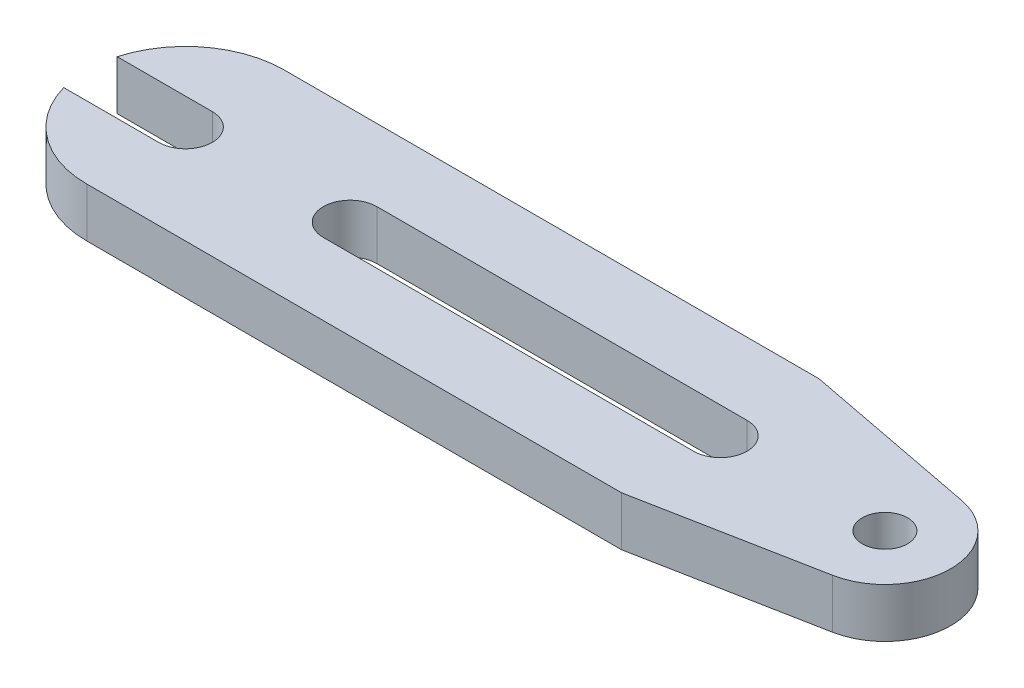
ISO-10303-21;
HEADER;
FILE_DESCRIPTION(('STEP AP214'),'2;1');
FILE_NAME('part.step','',(''),(''),'','','');
FILE_SCHEMA(('AUTOMOTIVE_DESIGN { 1 0 10303 214 1 1 1 1 }'));
ENDSEC;
DATA;
#1=APPLICATION_CONTEXT('core data for automotive mechanical design processes');
#2=APPLICATION_PROTOCOL_DEFINITION('international standard','automotive_design',2000,#1);
#3=PRODUCT_CONTEXT('',#1,'mechanical');
#4=PRODUCT('Part','Part','',(#3));
#5=PRODUCT_RELATED_PRODUCT_CATEGORY('part','',(#4));
#6=PRODUCT_DEFINITION_FORMATION('','',#4);
#7=PRODUCT_DEFINITION_CONTEXT('part definition',#1,'design');
#8=PRODUCT_DEFINITION('design','',#6,#7);
#9=PRODUCT_DEFINITION_SHAPE('','',#8);
#10=(LENGTH_UNIT() NAMED_UNIT(*) SI_UNIT(.MILLI.,.METRE.));
#11=(NAMED_UNIT(*) PLANE_ANGLE_UNIT() SI_UNIT($,.RADIAN.));
#12=(NAMED_UNIT(*) SI_UNIT($,.STERADIAN.) SOLID_ANGLE_UNIT());
#13=UNCERTAINTY_MEASURE_WITH_UNIT(LENGTH_MEASURE(1.E-05),#10,'distance_accuracy_value','');
#14=(GEOMETRIC_REPRESENTATION_CONTEXT(3) GLOBAL_UNCERTAINTY_ASSIGNED_CONTEXT((#13)) GLOBAL_UNIT_ASSIGNED_CONTEXT((#10,
#11,#12)) REPRESENTATION_CONTEXT('',''));
#15=CARTESIAN_POINT('',(0.,0.,0.));
#16=DIRECTION('',(0.,0.,1.));
#17=DIRECTION('',(1.,0.,0.));
#18=AXIS2_PLACEMENT_3D('',#15,#16,#17);
#19=CARTESIAN_POINT('',(85.,6.,0.));
#20=DIRECTION('',(0.,1.,0.));
#21=DIRECTION('',(0.,0.,1.));
#22=AXIS2_PLACEMENT_3D('',#19,#20,#21);
#23=PLANE('',#22);
#24=CARTESIAN_POINT('',(85.,6.,0.));
#25=DIRECTION('',(0.,1.,0.));
#26=DIRECTION('',(0.,0.,1.));
#27=AXIS2_PLACEMENT_3D('',#24,#25,#26);
#28=CIRCLE('',#27,2.75000000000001);
#29=CARTESIAN_POINT('',(85.,6.,2.75000000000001));
#30=VERTEX_POINT('',#29);
#31=EDGE_CURVE('E168',#30,#30,#28,.T.);
#32=ORIENTED_EDGE('',*,*,#31,.F.);
#33=EDGE_LOOP('',(#32));
#34=FACE_BOUND('',#33,.T.);
#35=DIRECTION('',(-0.981944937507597,0.,-0.189166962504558));
#36=VECTOR('',#35,1.);
#37=CARTESIAN_POINT('',(65.,6.,-12.));
#38=LINE('',#37,#36);
#39=CARTESIAN_POINT('',(86.5133357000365,6.,-7.85555950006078));
#40=VERTEX_POINT('',#39);
#41=CARTESIAN_POINT('',(65.,6.,-12.));
#42=VERTEX_POINT('',#41);
#43=EDGE_CURVE('E174',#40,#42,#38,.T.);
#44=ORIENTED_EDGE('',*,*,#43,.T.);
#45=DIRECTION('',(-1.,0.,0.));
#46=VECTOR('',#45,1.);
#47=CARTESIAN_POINT('',(0.,6.,-12.));
#48=LINE('',#47,#46);
#49=CARTESIAN_POINT('',(0.,6.,-12.));
#50=VERTEX_POINT('',#49);
#51=EDGE_CURVE('E177',#42,#50,#48,.T.);
#52=ORIENTED_EDGE('',*,*,#51,.T.);
#53=CARTESIAN_POINT('',(0.,6.,0.));
#54=DIRECTION('',(0.,1.,0.));
#55=DIRECTION('',(0.,0.,1.));
#56=AXIS2_PLACEMENT_3D('',#53,#54,#55);
#57=CIRCLE('',#56,12.);
#58=CARTESIAN_POINT('',(-11.5515150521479,6.,-3.25));
#59=VERTEX_POINT('',#58);
#60=EDGE_CURVE('E180',#50,#59,#57,.T.);
#61=ORIENTED_EDGE('',*,*,#60,.T.);
#62=DIRECTION('',(1.,0.,0.));
#63=VECTOR('',#62,1.);
#64=CARTESIAN_POINT('',(0.,6.,-3.25));
#65=LINE('',#64,#63);
#66=CARTESIAN_POINT('',(0.,6.,-3.25));
#67=VERTEX_POINT('',#66);
#68=EDGE_CURVE('E182',#59,#67,#65,.T.);
#69=ORIENTED_EDGE('',*,*,#68,.T.);
#70=CARTESIAN_POINT('',(0.,6.,0.));
#71=DIRECTION('',(0.,-1.,0.));
#72=DIRECTION('',(0.,0.,1.));
#73=AXIS2_PLACEMENT_3D('',#70,#71,#72);
#74=CIRCLE('',#73,3.25);
#75=CARTESIAN_POINT('',(0.,6.,3.25));
#76=VERTEX_POINT('',#75);
#77=EDGE_CURVE('E184',#67,#76,#74,.T.);
#78=ORIENTED_EDGE('',*,*,#77,.T.);
#79=DIRECTION('',(-1.,0.,0.));
#80=VECTOR('',#79,1.);
#81=CARTESIAN_POINT('',(0.,6.,3.25));
#82=LINE('',#81,#80);
#83=CARTESIAN_POINT('',(-11.5515150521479,6.,3.25));
#84=VERTEX_POINT('',#83);
#85=EDGE_CURVE('E186',#76,#84,#82,.T.);
#86=ORIENTED_EDGE('',*,*,#85,.T.);
#87=CARTESIAN_POINT('',(0.,6.,0.));
#88=DIRECTION('',(0.,1.,0.));
#89=DIRECTION('',(0.,0.,1.));
#90=AXIS2_PLACEMENT_3D('',#87,#88,#89);
#91=CIRCLE('',#90,12.);
#92=CARTESIAN_POINT('',(0.,6.,12.));
#93=VERTEX_POINT('',#92);
#94=EDGE_CURVE('E188',#84,#93,#91,.T.);
#95=ORIENTED_EDGE('',*,*,#94,.T.);
#96=DIRECTION('',(1.,0.,0.));
#97=VECTOR('',#96,1.);
#98=CARTESIAN_POINT('',(0.,6.,12.));
#99=LINE('',#98,#97);
#100=CARTESIAN_POINT('',(65.,6.,12.));
#101=VERTEX_POINT('',#100);
#102=EDGE_CURVE('E190',#93,#101,#99,.T.);
#103=ORIENTED_EDGE('',*,*,#102,.T.);
#104=DIRECTION('',(0.981944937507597,0.,-0.189166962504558));
#105=VECTOR('',#104,1.);
#106=CARTESIAN_POINT('',(65.,6.,12.));
#107=LINE('',#106,#105);
#108=CARTESIAN_POINT('',(86.5133357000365,6.,7.85555950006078));
#109=VERTEX_POINT('',#108);
#110=EDGE_CURVE('E192',#101,#109,#107,.T.);
#111=ORIENTED_EDGE('',*,*,#110,.T.);
#112=CARTESIAN_POINT('',(85.,6.,0.));
#113=DIRECTION('',(0.,1.,0.));
#114=DIRECTION('',(0.,0.,1.));
#115=AXIS2_PLACEMENT_3D('',#112,#113,#114);
#116=CIRCLE('',#115,8.);
#117=EDGE_CURVE('E194',#109,#40,#116,.T.);
#118=ORIENTED_EDGE('',*,*,#117,.T.);
#119=EDGE_LOOP('',(#44,#52,#61,#69,#78,#86,#95,#103,#111,#118));
#120=FACE_BOUND('',#119,.T.);
#121=DIRECTION('',(1.,0.,0.));
#122=VECTOR('',#121,1.);
#123=CARTESIAN_POINT('',(20.,6.,3.25));
#124=LINE('',#123,#122);
#125=CARTESIAN_POINT('',(20.,6.,3.25));
#126=VERTEX_POINT('',#125);
#127=CARTESIAN_POINT('',(65.,6.,3.25));
#128=VERTEX_POINT('',#127);
#129=EDGE_CURVE('E140',#126,#128,#124,.T.);
#130=ORIENTED_EDGE('',*,*,#129,.F.);
#131=CARTESIAN_POINT('',(20.,6.,0.));
#132=DIRECTION('',(0.,1.,0.));
#133=DIRECTION('',(0.,0.,1.));
#134=AXIS2_PLACEMENT_3D('',#131,#132,#133);
#135=CIRCLE('',#134,3.25);
#136=CARTESIAN_POINT('',(20.,6.,-3.25));
#137=VERTEX_POINT('',#136);
#138=EDGE_CURVE('E132',#137,#126,#135,.T.);
#139=ORIENTED_EDGE('',*,*,#138,.F.);
#140=DIRECTION('',(-1.,0.,0.));
#141=VECTOR('',#140,1.);
#142=CARTESIAN_POINT('',(65.,6.,-3.25));
#143=LINE('',#142,#141);
#144=CARTESIAN_POINT('',(65.,6.,-3.25));
#145=VERTEX_POINT('',#144);
#146=EDGE_CURVE('E154',#145,#137,#143,.T.);
#147=ORIENTED_EDGE('',*,*,#146,.F.);
#148=CARTESIAN_POINT('',(65.,6.,0.));
#149=DIRECTION('',(0.,1.,0.));
#150=DIRECTION('',(0.,0.,1.));
#151=AXIS2_PLACEMENT_3D('',#148,#149,#150);
#152=CIRCLE('',#151,3.25);
#153=EDGE_CURVE('E152',#128,#145,#152,.T.);
#154=ORIENTED_EDGE('',*,*,#153,.F.);
#155=EDGE_LOOP('',(#130,#139,#147,#154));
#156=FACE_BOUND('',#155,.T.);
#157=ADVANCED_FACE('F31',(#34,#120,#156),#23,.T.);
#158=CARTESIAN_POINT('',(85.,0.,0.));
#159=DIRECTION('',(0.,1.,0.));
#160=DIRECTION('',(0.,0.,1.));
#161=AXIS2_PLACEMENT_3D('',#158,#159,#160);
#162=PLANE('',#161);
#163=CARTESIAN_POINT('',(85.,0.,0.));
#164=DIRECTION('',(0.,1.,0.));
#165=DIRECTION('',(0.,0.,1.));
#166=AXIS2_PLACEMENT_3D('',#163,#164,#165);
#167=CIRCLE('',#166,2.75000000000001);
#168=CARTESIAN_POINT('',(85.,0.,2.75000000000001));
#169=VERTEX_POINT('',#168);
#170=EDGE_CURVE('E148',#169,#169,#167,.T.);
#171=ORIENTED_EDGE('',*,*,#170,.T.);
#172=EDGE_LOOP('',(#171));
#173=FACE_BOUND('',#172,.T.);
#174=DIRECTION('',(-0.981944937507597,0.,-0.189166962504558));
#175=VECTOR('',#174,1.);
#176=CARTESIAN_POINT('',(65.,0.,-12.));
#177=LINE('',#176,#175);
#178=CARTESIAN_POINT('',(86.5133357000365,0.,-7.85555950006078));
#179=VERTEX_POINT('',#178);
#180=CARTESIAN_POINT('',(65.,0.,-12.));
#181=VERTEX_POINT('',#180);
#182=EDGE_CURVE('E171',#179,#181,#177,.T.);
#183=ORIENTED_EDGE('',*,*,#182,.F.);
#184=CARTESIAN_POINT('',(85.,0.,0.));
#185=DIRECTION('',(0.,1.,0.));
#186=DIRECTION('',(0.,0.,1.));
#187=AXIS2_PLACEMENT_3D('',#184,#185,#186);
#188=CIRCLE('',#187,8.);
#189=CARTESIAN_POINT('',(86.5133357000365,0.,7.85555950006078));
#190=VERTEX_POINT('',#189);
#191=EDGE_CURVE('E178',#190,#179,#188,.T.);
#192=ORIENTED_EDGE('',*,*,#191,.F.);
#193=DIRECTION('',(0.981944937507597,0.,-0.189166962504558));
#194=VECTOR('',#193,1.);
#195=CARTESIAN_POINT('',(65.,0.,12.));
#196=LINE('',#195,#194);
#197=CARTESIAN_POINT('',(65.,0.,12.));
#198=VERTEX_POINT('',#197);
#199=EDGE_CURVE('E213',#198,#190,#196,.T.);
#200=ORIENTED_EDGE('',*,*,#199,.F.);
#201=DIRECTION('',(1.,0.,0.));
#202=VECTOR('',#201,1.);
#203=CARTESIAN_POINT('',(0.,0.,12.));
#204=LINE('',#203,#202);
#205=CARTESIAN_POINT('',(0.,0.,12.));
#206=VERTEX_POINT('',#205);
#207=EDGE_CURVE('E211',#206,#198,#204,.T.);
#208=ORIENTED_EDGE('',*,*,#207,.F.);
#209=CARTESIAN_POINT('',(0.,0.,0.));
#210=DIRECTION('',(0.,1.,0.));
#211=DIRECTION('',(0.,0.,1.));
#212=AXIS2_PLACEMENT_3D('',#209,#210,#211);
#213=CIRCLE('',#212,12.);
#214=CARTESIAN_POINT('',(-11.5515150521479,0.,3.25));
#215=VERTEX_POINT('',#214);
#216=EDGE_CURVE('E209',#215,#206,#213,.T.);
#217=ORIENTED_EDGE('',*,*,#216,.F.);
#218=DIRECTION('',(-1.,0.,0.));
#219=VECTOR('',#218,1.);
#220=CARTESIAN_POINT('',(0.,0.,3.25));
#221=LINE('',#220,#219);
#222=CARTESIAN_POINT('',(0.,0.,3.25));
#223=VERTEX_POINT('',#222);
#224=EDGE_CURVE('E207',#223,#215,#221,.T.);
#225=ORIENTED_EDGE('',*,*,#224,.F.);
#226=CARTESIAN_POINT('',(0.,0.,0.));
#227=DIRECTION('',(0.,-1.,0.));
#228=DIRECTION('',(0.,0.,1.));
#229=AXIS2_PLACEMENT_3D('',#226,#227,#228);
#230=CIRCLE('',#229,3.25);
#231=CARTESIAN_POINT('',(0.,0.,-3.25));
#232=VERTEX_POINT('',#231);
#233=EDGE_CURVE('E205',#232,#223,#230,.T.);
#234=ORIENTED_EDGE('',*,*,#233,.F.);
#235=DIRECTION('',(1.,0.,0.));
#236=VECTOR('',#235,1.);
#237=CARTESIAN_POINT('',(0.,0.,-3.25));
#238=LINE('',#237,#236);
#239=CARTESIAN_POINT('',(-11.5515150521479,0.,-3.25));
#240=VERTEX_POINT('',#239);
#241=EDGE_CURVE('E203',#240,#232,#238,.T.);
#242=ORIENTED_EDGE('',*,*,#241,.F.);
#243=CARTESIAN_POINT('',(0.,0.,0.));
#244=DIRECTION('',(0.,1.,0.));
#245=DIRECTION('',(0.,0.,1.));
#246=AXIS2_PLACEMENT_3D('',#243,#244,#245);
#247=CIRCLE('',#246,12.);
#248=CARTESIAN_POINT('',(0.,0.,-12.));
#249=VERTEX_POINT('',#248);
#250=EDGE_CURVE('E201',#249,#240,#247,.T.);
#251=ORIENTED_EDGE('',*,*,#250,.F.);
#252=DIRECTION('',(-1.,0.,0.));
#253=VECTOR('',#252,1.);
#254=CARTESIAN_POINT('',(0.,0.,-12.));
#255=LINE('',#254,#253);
#256=EDGE_CURVE('E199',#181,#249,#255,.T.);
#257=ORIENTED_EDGE('',*,*,#256,.F.);
#258=EDGE_LOOP('',(#183,#192,#200,#208,#217,#225,#234,#242,#251,#257));
#259=FACE_BOUND('',#258,.T.);
#260=CARTESIAN_POINT('',(20.,0.,0.));
#261=DIRECTION('',(0.,1.,0.));
#262=DIRECTION('',(0.,0.,1.));
#263=AXIS2_PLACEMENT_3D('',#260,#261,#262);
#264=CIRCLE('',#263,3.25);
#265=CARTESIAN_POINT('',(20.,0.,-3.25));
#266=VERTEX_POINT('',#265);
#267=CARTESIAN_POINT('',(20.,0.,3.25));
#268=VERTEX_POINT('',#267);
#269=EDGE_CURVE('E54',#266,#268,#264,.T.);
#270=ORIENTED_EDGE('',*,*,#269,.T.);
#271=DIRECTION('',(1.,0.,0.));
#272=VECTOR('',#271,1.);
#273=CARTESIAN_POINT('',(20.,0.,3.25));
#274=LINE('',#273,#272);
#275=CARTESIAN_POINT('',(65.,0.,3.25));
#276=VERTEX_POINT('',#275);
#277=EDGE_CURVE('E147',#268,#276,#274,.T.);
#278=ORIENTED_EDGE('',*,*,#277,.T.);
#279=CARTESIAN_POINT('',(65.,0.,0.));
#280=DIRECTION('',(0.,1.,0.));
#281=DIRECTION('',(0.,0.,1.));
#282=AXIS2_PLACEMENT_3D('',#279,#280,#281);
#283=CIRCLE('',#282,3.25);
#284=CARTESIAN_POINT('',(65.,0.,-3.25));
#285=VERTEX_POINT('',#284);
#286=EDGE_CURVE('E160',#276,#285,#283,.T.);
#287=ORIENTED_EDGE('',*,*,#286,.T.);
#288=DIRECTION('',(-1.,0.,0.));
#289=VECTOR('',#288,1.);
#290=CARTESIAN_POINT('',(65.,0.,-3.25));
#291=LINE('',#290,#289);
#292=EDGE_CURVE('E141',#285,#266,#291,.T.);
#293=ORIENTED_EDGE('',*,*,#292,.T.);
#294=EDGE_LOOP('',(#270,#278,#287,#293));
#295=FACE_BOUND('',#294,.T.);
#296=ADVANCED_FACE('F249',(#173,#259,#295),#162,.F.);
#297=CARTESIAN_POINT('',(65.,6.,-12.));
#298=DIRECTION('',(-0.189166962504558,0.,0.981944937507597));
#299=DIRECTION('',(0.981944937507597,0.,0.189166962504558));
#300=AXIS2_PLACEMENT_3D('',#297,#298,#299);
#301=PLANE('',#300);
#302=ORIENTED_EDGE('',*,*,#182,.T.);
#303=DIRECTION('',(0.,-1.,0.));
#304=VECTOR('',#303,1.);
#305=CARTESIAN_POINT('',(65.,6.,-12.));
#306=LINE('',#305,#304);
#307=EDGE_CURVE('E11',#42,#181,#306,.T.);
#308=ORIENTED_EDGE('',*,*,#307,.F.);
#309=ORIENTED_EDGE('',*,*,#43,.F.);
#310=DIRECTION('',(0.,-1.,0.));
#311=VECTOR('',#310,1.);
#312=CARTESIAN_POINT('',(86.5133357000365,6.,-7.85555950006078));
#313=LINE('',#312,#311);
#314=EDGE_CURVE('E196',#40,#179,#313,.T.);
#315=ORIENTED_EDGE('',*,*,#314,.T.);
#316=EDGE_LOOP('',(#302,#308,#309,#315));
#317=FACE_BOUND('',#316,.T.);
#318=ADVANCED_FACE('F33',(#317),#301,.F.);
#319=CARTESIAN_POINT('',(0.,6.,-12.));
#320=DIRECTION('',(0.,0.,1.));
#321=DIRECTION('',(1.,0.,0.));
#322=AXIS2_PLACEMENT_3D('',#319,#320,#321);
#323=PLANE('',#322);
#324=ORIENTED_EDGE('',*,*,#256,.T.);
#325=DIRECTION('',(0.,-1.,0.));
#326=VECTOR('',#325,1.);
#327=CARTESIAN_POINT('',(0.,6.,-12.));
#328=LINE('',#327,#326);
#329=EDGE_CURVE('E39',#50,#249,#328,.T.);
#330=ORIENTED_EDGE('',*,*,#329,.F.);
#331=ORIENTED_EDGE('',*,*,#51,.F.);
#332=ORIENTED_EDGE('',*,*,#307,.T.);
#333=EDGE_LOOP('',(#324,#330,#331,#332));
#334=FACE_BOUND('',#333,.T.);
#335=ADVANCED_FACE('F266',(#334),#323,.F.);
#336=CARTESIAN_POINT('',(0.,6.,0.));
#337=DIRECTION('',(0.,-1.,0.));
#338=DIRECTION('',(0.,0.,-1.));
#339=AXIS2_PLACEMENT_3D('',#336,#337,#338);
#340=CYLINDRICAL_SURFACE('',#339,12.);
#341=ORIENTED_EDGE('',*,*,#250,.T.);
#342=DIRECTION('',(0.,-1.,0.));
#343=VECTOR('',#342,1.);
#344=CARTESIAN_POINT('',(-11.5515150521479,6.,-3.25));
#345=LINE('',#344,#343);
#346=EDGE_CURVE('E236',#59,#240,#345,.T.);
#347=ORIENTED_EDGE('',*,*,#346,.F.);
#348=ORIENTED_EDGE('',*,*,#60,.F.);
#349=ORIENTED_EDGE('',*,*,#329,.T.);
#350=EDGE_LOOP('',(#341,#347,#348,#349));
#351=FACE_BOUND('',#350,.T.);
#352=ADVANCED_FACE('F243',(#351),#340,.T.);
#353=CARTESIAN_POINT('',(0.,6.,-3.25));
#354=DIRECTION('',(0.,0.,-1.));
#355=DIRECTION('',(-1.,0.,0.));
#356=AXIS2_PLACEMENT_3D('',#353,#354,#355);
#357=PLANE('',#356);
#358=ORIENTED_EDGE('',*,*,#241,.T.);
#359=DIRECTION('',(0.,-1.,0.));
#360=VECTOR('',#359,1.);
#361=CARTESIAN_POINT('',(0.,6.,-3.25));
#362=LINE('',#361,#360);
#363=EDGE_CURVE('E233',#67,#232,#362,.T.);
#364=ORIENTED_EDGE('',*,*,#363,.F.);
#365=ORIENTED_EDGE('',*,*,#68,.F.);
#366=ORIENTED_EDGE('',*,*,#346,.T.);
#367=EDGE_LOOP('',(#358,#364,#365,#366));
#368=FACE_BOUND('',#367,.T.);
#369=ADVANCED_FACE('F255',(#368),#357,.F.);
#370=CARTESIAN_POINT('',(0.,6.,0.));
#371=DIRECTION('',(0.,-1.,0.));
#372=DIRECTION('',(0.,0.,-1.));
#373=AXIS2_PLACEMENT_3D('',#370,#371,#372);
#374=CYLINDRICAL_SURFACE('',#373,3.25);
#375=ORIENTED_EDGE('',*,*,#233,.T.);
#376=DIRECTION('',(0.,-1.,0.));
#377=VECTOR('',#376,1.);
#378=CARTESIAN_POINT('',(0.,6.,3.25));
#379=LINE('',#378,#377);
#380=EDGE_CURVE('E230',#76,#223,#379,.T.);
#381=ORIENTED_EDGE('',*,*,#380,.F.);
#382=ORIENTED_EDGE('',*,*,#77,.F.);
#383=ORIENTED_EDGE('',*,*,#363,.T.);
#384=EDGE_LOOP('',(#375,#381,#382,#383));
#385=FACE_BOUND('',#384,.T.);
#386=ADVANCED_FACE('F259',(#385),#374,.F.);
#387=CARTESIAN_POINT('',(0.,6.,3.25));
#388=DIRECTION('',(0.,0.,1.));
#389=DIRECTION('',(1.,0.,0.));
#390=AXIS2_PLACEMENT_3D('',#387,#388,#389);
#391=PLANE('',#390);
#392=ORIENTED_EDGE('',*,*,#224,.T.);
#393=DIRECTION('',(0.,-1.,0.));
#394=VECTOR('',#393,1.);
#395=CARTESIAN_POINT('',(-11.5515150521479,6.,3.25));
#396=LINE('',#395,#394);
#397=EDGE_CURVE('E227',#84,#215,#396,.T.);
#398=ORIENTED_EDGE('',*,*,#397,.F.);
#399=ORIENTED_EDGE('',*,*,#85,.F.);
#400=ORIENTED_EDGE('',*,*,#380,.T.);
#401=EDGE_LOOP('',(#392,#398,#399,#400));
#402=FACE_BOUND('',#401,.T.);
#403=ADVANCED_FACE('F289',(#402),#391,.F.);
#404=CARTESIAN_POINT('',(0.,6.,0.));
#405=DIRECTION('',(0.,-1.,0.));
#406=DIRECTION('',(0.,0.,-1.));
#407=AXIS2_PLACEMENT_3D('',#404,#405,#406);
#408=CYLINDRICAL_SURFACE('',#407,12.);
#409=ORIENTED_EDGE('',*,*,#216,.T.);
#410=DIRECTION('',(0.,-1.,0.));
#411=VECTOR('',#410,1.);
#412=CARTESIAN_POINT('',(0.,6.,12.));
#413=LINE('',#412,#411);
#414=EDGE_CURVE('E224',#93,#206,#413,.T.);
#415=ORIENTED_EDGE('',*,*,#414,.F.);
#416=ORIENTED_EDGE('',*,*,#94,.F.);
#417=ORIENTED_EDGE('',*,*,#397,.T.);
#418=EDGE_LOOP('',(#409,#415,#416,#417));
#419=FACE_BOUND('',#418,.T.);
#420=ADVANCED_FACE('F286',(#419),#408,.T.);
#421=CARTESIAN_POINT('',(0.,6.,12.));
#422=DIRECTION('',(0.,0.,-1.));
#423=DIRECTION('',(-1.,0.,0.));
#424=AXIS2_PLACEMENT_3D('',#421,#422,#423);
#425=PLANE('',#424);
#426=ORIENTED_EDGE('',*,*,#207,.T.);
#427=DIRECTION('',(0.,-1.,0.));
#428=VECTOR('',#427,1.);
#429=CARTESIAN_POINT('',(65.,6.,12.));
#430=LINE('',#429,#428);
#431=EDGE_CURVE('E221',#101,#198,#430,.T.);
#432=ORIENTED_EDGE('',*,*,#431,.F.);
#433=ORIENTED_EDGE('',*,*,#102,.F.);
#434=ORIENTED_EDGE('',*,*,#414,.T.);
#435=EDGE_LOOP('',(#426,#432,#433,#434));
#436=FACE_BOUND('',#435,.T.);
#437=ADVANCED_FACE('F282',(#436),#425,.F.);
#438=CARTESIAN_POINT('',(65.,6.,12.));
#439=DIRECTION('',(-0.189166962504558,0.,-0.981944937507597));
#440=DIRECTION('',(-0.981944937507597,0.,0.189166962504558));
#441=AXIS2_PLACEMENT_3D('',#438,#439,#440);
#442=PLANE('',#441);
#443=ORIENTED_EDGE('',*,*,#199,.T.);
#444=DIRECTION('',(0.,-1.,0.));
#445=VECTOR('',#444,1.);
#446=CARTESIAN_POINT('',(86.5133357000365,6.,7.85555950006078));
#447=LINE('',#446,#445);
#448=EDGE_CURVE('E218',#109,#190,#447,.T.);
#449=ORIENTED_EDGE('',*,*,#448,.F.);
#450=ORIENTED_EDGE('',*,*,#110,.F.);
#451=ORIENTED_EDGE('',*,*,#431,.T.);
#452=EDGE_LOOP('',(#443,#449,#450,#451));
#453=FACE_BOUND('',#452,.T.);
#454=ADVANCED_FACE('F278',(#453),#442,.F.);
#455=CARTESIAN_POINT('',(85.,6.,0.));
#456=DIRECTION('',(0.,-1.,0.));
#457=DIRECTION('',(0.,0.,-1.));
#458=AXIS2_PLACEMENT_3D('',#455,#456,#457);
#459=CYLINDRICAL_SURFACE('',#458,8.);
#460=ORIENTED_EDGE('',*,*,#191,.T.);
#461=ORIENTED_EDGE('',*,*,#314,.F.);
#462=ORIENTED_EDGE('',*,*,#117,.F.);
#463=ORIENTED_EDGE('',*,*,#448,.T.);
#464=EDGE_LOOP('',(#460,#461,#462,#463));
#465=FACE_BOUND('',#464,.T.);
#466=ADVANCED_FACE('F273',(#465),#459,.T.);
#467=CARTESIAN_POINT('',(85.,6.,0.));
#468=DIRECTION('',(0.,-1.,0.));
#469=DIRECTION('',(0.,0.,-1.));
#470=AXIS2_PLACEMENT_3D('',#467,#468,#469);
#471=CYLINDRICAL_SURFACE('',#470,2.75000000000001);
#472=ORIENTED_EDGE('',*,*,#31,.T.);
#473=EDGE_LOOP('',(#472));
#474=FACE_BOUND('',#473,.T.);
#475=ORIENTED_EDGE('',*,*,#170,.F.);
#476=EDGE_LOOP('',(#475));
#477=FACE_BOUND('',#476,.T.);
#478=ADVANCED_FACE('F308',(#474,#477),#471,.F.);
#479=CARTESIAN_POINT('',(20.,6.,0.));
#480=DIRECTION('',(0.,-1.,0.));
#481=DIRECTION('',(0.,0.,-1.));
#482=AXIS2_PLACEMENT_3D('',#479,#480,#481);
#483=CYLINDRICAL_SURFACE('',#482,3.25);
#484=ORIENTED_EDGE('',*,*,#269,.F.);
#485=DIRECTION('',(0.,-1.,0.));
#486=VECTOR('',#485,1.);
#487=CARTESIAN_POINT('',(20.,6.,-3.25));
#488=LINE('',#487,#486);
#489=EDGE_CURVE('E136',#137,#266,#488,.T.);
#490=ORIENTED_EDGE('',*,*,#489,.F.);
#491=ORIENTED_EDGE('',*,*,#138,.T.);
#492=DIRECTION('',(0.,-1.,0.));
#493=VECTOR('',#492,1.);
#494=CARTESIAN_POINT('',(20.,6.,3.25));
#495=LINE('',#494,#493);
#496=EDGE_CURVE('E135',#126,#268,#495,.T.);
#497=ORIENTED_EDGE('',*,*,#496,.T.);
#498=EDGE_LOOP('',(#484,#490,#491,#497));
#499=FACE_BOUND('',#498,.T.);
#500=ADVANCED_FACE('F134',(#499),#483,.F.);
#501=CARTESIAN_POINT('',(20.,6.,3.25));
#502=DIRECTION('',(0.,0.,-1.));
#503=DIRECTION('',(-1.,0.,0.));
#504=AXIS2_PLACEMENT_3D('',#501,#502,#503);
#505=PLANE('',#504);
#506=ORIENTED_EDGE('',*,*,#277,.F.);
#507=ORIENTED_EDGE('',*,*,#496,.F.);
#508=ORIENTED_EDGE('',*,*,#129,.T.);
#509=DIRECTION('',(0.,-1.,0.));
#510=VECTOR('',#509,1.);
#511=CARTESIAN_POINT('',(65.,6.,3.25));
#512=LINE('',#511,#510);
#513=EDGE_CURVE('E149',#128,#276,#512,.T.);
#514=ORIENTED_EDGE('',*,*,#513,.T.);
#515=EDGE_LOOP('',(#506,#507,#508,#514));
#516=FACE_BOUND('',#515,.T.);
#517=ADVANCED_FACE('F144',(#516),#505,.T.);
#518=CARTESIAN_POINT('',(65.,6.,0.));
#519=DIRECTION('',(0.,-1.,0.));
#520=DIRECTION('',(0.,0.,-1.));
#521=AXIS2_PLACEMENT_3D('',#518,#519,#520);
#522=CYLINDRICAL_SURFACE('',#521,3.25);
#523=ORIENTED_EDGE('',*,*,#286,.F.);
#524=ORIENTED_EDGE('',*,*,#513,.F.);
#525=ORIENTED_EDGE('',*,*,#153,.T.);
#526=DIRECTION('',(0.,-1.,0.));
#527=VECTOR('',#526,1.);
#528=CARTESIAN_POINT('',(65.,6.,-3.25));
#529=LINE('',#528,#527);
#530=EDGE_CURVE('E46',#145,#285,#529,.T.);
#531=ORIENTED_EDGE('',*,*,#530,.T.);
#532=EDGE_LOOP('',(#523,#524,#525,#531));
#533=FACE_BOUND('',#532,.T.);
#534=ADVANCED_FACE('F345',(#533),#522,.F.);
#535=CARTESIAN_POINT('',(65.,6.,-3.25));
#536=DIRECTION('',(0.,0.,1.));
#537=DIRECTION('',(1.,0.,0.));
#538=AXIS2_PLACEMENT_3D('',#535,#536,#537);
#539=PLANE('',#538);
#540=ORIENTED_EDGE('',*,*,#292,.F.);
#541=ORIENTED_EDGE('',*,*,#530,.F.);
#542=ORIENTED_EDGE('',*,*,#146,.T.);
#543=ORIENTED_EDGE('',*,*,#489,.T.);
#544=EDGE_LOOP('',(#540,#541,#542,#543));
#545=FACE_BOUND('',#544,.T.);
#546=ADVANCED_FACE('F352',(#545),#539,.T.);
#547=CLOSED_SHELL('',(#157,#296,#318,#335,#352,#369,#386,#403,#420,#437,#454,#466,#478,#500,
#517,#534,#546));
#548=MANIFOLD_SOLID_BREP('B2',#547);
#549=ADVANCED_BREP_SHAPE_REPRESENTATION('',(#18,#548),#14);
#550=SHAPE_DEFINITION_REPRESENTATION(#9,#549);
ENDSEC;
END-ISO-10303-21;
